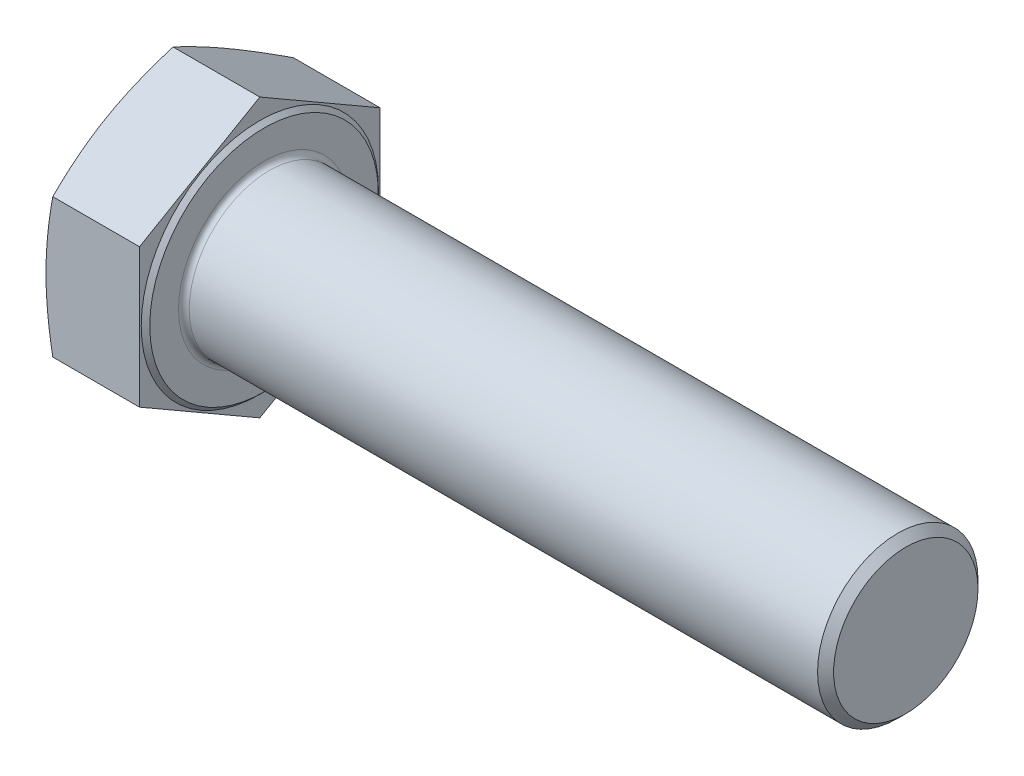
from build123d import *

# Parameters (mm, degrees)
BASEHEAD_DEPTH = 18.28
SKETCH5_R      = 15
BASEBODY_DEPTH = 120
CHAMFER1_SIZE  = 1.5
HEADFILLET_R   = 1


with BuildPart() as part:
    # Sketch2 → BaseHead (new body)
    with BuildSketch(Plane(origin=(0, 0, 0), x_dir=(0, 0, -1), z_dir=(1, 0, 0))):
        Polygon((0, -25.980762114), (22.5, -12.990381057), (22.5, 12.990381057), (0, 25.980762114), (-22.5, 12.990381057), (-22.5, -12.990381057), align=None)
    extrude(amount=BASEHEAD_DEPTH)

    # Sketch3 → BearingFace (revolve, cut)
    with BuildSketch(Plane.XY, mode=Mode.PRIVATE) as bearingface_sk:
        Polygon((18.28, 25.980762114), (18.28, 21.375), (17.48, 22.175), (17.48, 25.980762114), align=None)
    revolve(bearingface_sk.sketch.rotate(Axis((-0.957090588, 0, 0), (1, 0, 0)), 90), axis=Axis((-0.957090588, 0, 0), (1, 0, 0)), mode=Mode.SUBTRACT)

    # Sketch4 → HeadChamfer (revolve, cut)
    with BuildSketch(Plane.XY):
        Polygon((0, 25.980762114), (1.266893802, 25.980762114), (0, 22.5), align=None)
    revolve(axis=Axis((-0.493528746, 0, 0), (1, 0, 0)), mode=Mode.SUBTRACT)

    # Sketch5 → BaseBody (add)
    with BuildSketch(Plane(origin=(18.28, 0, 0), x_dir=(0, 0, -1), z_dir=(1, 0, 0))):
        with Locations(Location((0, 0, 0), (0, 0, 180))):
            Circle(SKETCH5_R)
    extrude(amount=BASEBODY_DEPTH)

    # Chamfer1
    chamfer1_edges = [part.edges().sort_by_distance(p)[0] for p in [
        (138.28, 0, -15),
    ]]
    chamfer(chamfer1_edges, length=CHAMFER1_SIZE)

    # HeadFillet
    headfillet_edges = [part.edges().sort_by_distance(p)[0] for p in [
        (18.28, 0, -15),
    ]]
    fillet(headfillet_edges, radius=HEADFILLET_R)


solid = part.part
